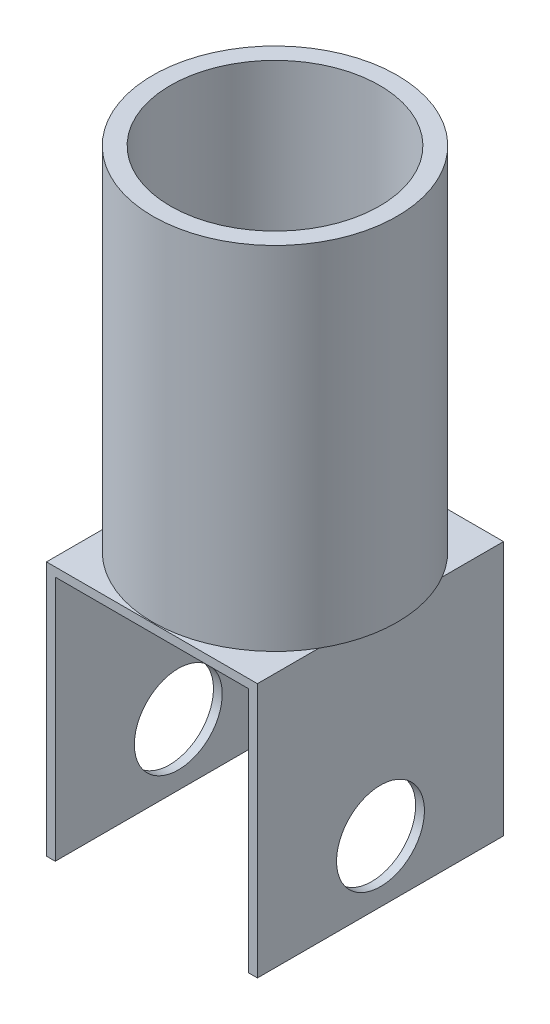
from build123d import *

# Parameters (mm, degrees)
SKETCH1_R               = 69.5
SKETCH1_R_2             = 59.5
BOSS_EXTRUDE1_DEPTH     = 200
SKETCH2_W               = 120
SKETCH2_H               = 140
BOSS_EXTRUDE2_DEPTH     = 5
SKETCH3_W               = 5
SKETCH3_H               = 140
BOSS_EXTRUDE3_DEPTH     = 140
CUT_EXTRUDE1_DEPTH      = 249.334955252
CUT_EXTRUDE1_DEPTH_BACK = 249.334955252
SKETCH4_R               = 25


with BuildPart() as part:
    # Sketch1 → Boss-Extrude1 (new body)
    with BuildSketch(Plane(origin=(0, 0, 0), x_dir=(1, 0, 0), z_dir=(0, 1, 0))):
        with Locations(Location((0, 0, 0), (0, 0, 270))):
            Circle(SKETCH1_R)
        with Locations(Location((0, 0, 0), (0, 0, 270))):
            Circle(SKETCH1_R_2, mode=Mode.SUBTRACT)
    extrude(amount=BOSS_EXTRUDE1_DEPTH)

    # Sketch2 → Boss-Extrude2 (add)
    with BuildSketch(Plane.XZ):
        Rectangle(SKETCH2_W, SKETCH2_H)
    extrude(amount=BOSS_EXTRUDE2_DEPTH)

    # Sketch3 → Boss-Extrude3 (add)
    with BuildSketch(Plane.XZ.offset(5)):
        with Locations((-57.5, 0)):
            Rectangle(SKETCH3_W, SKETCH3_H)
        with Locations((57.5, 0)):
            Rectangle(SKETCH3_W, SKETCH3_H)
    extrude(amount=BOSS_EXTRUDE3_DEPTH)

    # Sketch4 → Cut-Extrude1 (cut, two sides: drawn at the far end of the back side and taken through both)
    with BuildSketch(Plane.ZY.offset(60).offset(-CUT_EXTRUDE1_DEPTH_BACK)):
        with Locations((0, -110)):
            Circle(SKETCH4_R)
    extrude(amount=CUT_EXTRUDE1_DEPTH + CUT_EXTRUDE1_DEPTH_BACK, mode=Mode.SUBTRACT)


solid = part.part
